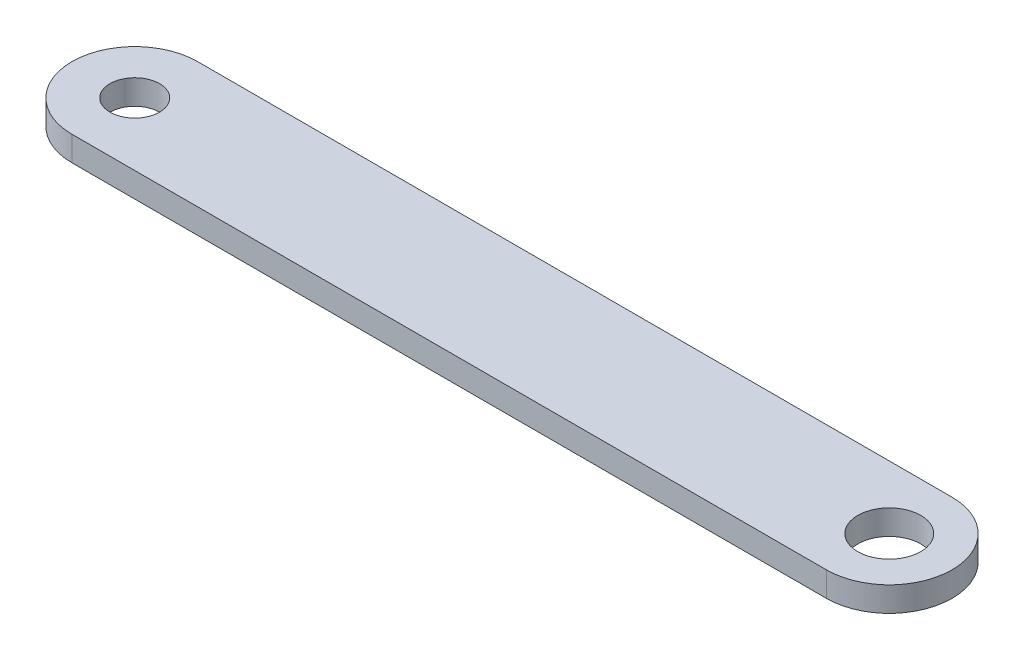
ISO-10303-21;
HEADER;
FILE_DESCRIPTION(('STEP AP214'),'2;1');
FILE_NAME('part.step','',(''),(''),'','','');
FILE_SCHEMA(('AUTOMOTIVE_DESIGN { 1 0 10303 214 1 1 1 1 }'));
ENDSEC;
DATA;
#1=APPLICATION_CONTEXT('core data for automotive mechanical design processes');
#2=APPLICATION_PROTOCOL_DEFINITION('international standard','automotive_design',2000,#1);
#3=PRODUCT_CONTEXT('',#1,'mechanical');
#4=PRODUCT('Part','Part','',(#3));
#5=PRODUCT_RELATED_PRODUCT_CATEGORY('part','',(#4));
#6=PRODUCT_DEFINITION_FORMATION('','',#4);
#7=PRODUCT_DEFINITION_CONTEXT('part definition',#1,'design');
#8=PRODUCT_DEFINITION('design','',#6,#7);
#9=PRODUCT_DEFINITION_SHAPE('','',#8);
#10=(LENGTH_UNIT() NAMED_UNIT(*) SI_UNIT(.MILLI.,.METRE.));
#11=(NAMED_UNIT(*) PLANE_ANGLE_UNIT() SI_UNIT($,.RADIAN.));
#12=(NAMED_UNIT(*) SI_UNIT($,.STERADIAN.) SOLID_ANGLE_UNIT());
#13=UNCERTAINTY_MEASURE_WITH_UNIT(LENGTH_MEASURE(1.E-05),#10,'distance_accuracy_value','');
#14=(GEOMETRIC_REPRESENTATION_CONTEXT(3) GLOBAL_UNCERTAINTY_ASSIGNED_CONTEXT((#13)) GLOBAL_UNIT_ASSIGNED_CONTEXT((#10,
#11,#12)) REPRESENTATION_CONTEXT('',''));
#15=CARTESIAN_POINT('',(0.,0.,0.));
#16=DIRECTION('',(0.,0.,1.));
#17=DIRECTION('',(1.,0.,0.));
#18=AXIS2_PLACEMENT_3D('',#15,#16,#17);
#19=CARTESIAN_POINT('',(-73.5541666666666,5.,1.32291666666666));
#20=DIRECTION('',(0.,-1.,0.));
#21=DIRECTION('',(0.,0.,-1.));
#22=AXIS2_PLACEMENT_3D('',#19,#20,#21);
#23=CYLINDRICAL_SURFACE('',#22,12.7);
#24=CARTESIAN_POINT('',(-73.5541666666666,0.,1.32291666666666));
#25=DIRECTION('',(0.,1.,0.));
#26=DIRECTION('',(0.,0.,-1.));
#27=AXIS2_PLACEMENT_3D('',#24,#25,#26);
#28=CIRCLE('',#27,12.7);
#29=CARTESIAN_POINT('',(-73.5541666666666,0.,-11.3770833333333));
#30=VERTEX_POINT('',#29);
#31=CARTESIAN_POINT('',(-73.5541666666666,0.,14.0229166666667));
#32=VERTEX_POINT('',#31);
#33=EDGE_CURVE('E96',#30,#32,#28,.T.);
#34=ORIENTED_EDGE('',*,*,#33,.T.);
#35=DIRECTION('',(0.,-1.,0.));
#36=VECTOR('',#35,1.);
#37=CARTESIAN_POINT('',(-73.5541666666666,5.,14.0229166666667));
#38=LINE('',#37,#36);
#39=CARTESIAN_POINT('',(-73.5541666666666,5.,14.0229166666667));
#40=VERTEX_POINT('',#39);
#41=EDGE_CURVE('E11',#40,#32,#38,.T.);
#42=ORIENTED_EDGE('',*,*,#41,.F.);
#43=CARTESIAN_POINT('',(-73.5541666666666,5.,1.32291666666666));
#44=DIRECTION('',(0.,1.,0.));
#45=DIRECTION('',(0.,0.,-1.));
#46=AXIS2_PLACEMENT_3D('',#43,#44,#45);
#47=CIRCLE('',#46,12.7);
#48=CARTESIAN_POINT('',(-73.5541666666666,5.,-11.3770833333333));
#49=VERTEX_POINT('',#48);
#50=EDGE_CURVE('E84',#49,#40,#47,.T.);
#51=ORIENTED_EDGE('',*,*,#50,.F.);
#52=DIRECTION('',(0.,-1.,0.));
#53=VECTOR('',#52,1.);
#54=CARTESIAN_POINT('',(-73.5541666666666,5.,-11.3770833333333));
#55=LINE('',#54,#53);
#56=EDGE_CURVE('E92',#49,#30,#55,.T.);
#57=ORIENTED_EDGE('',*,*,#56,.T.);
#58=EDGE_LOOP('',(#34,#42,#51,#57));
#59=FACE_BOUND('',#58,.T.);
#60=ADVANCED_FACE('F33',(#59),#23,.T.);
#61=CARTESIAN_POINT('',(-73.5541666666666,5.,14.0229166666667));
#62=DIRECTION('',(0.,0.,-1.));
#63=DIRECTION('',(-1.,0.,0.));
#64=AXIS2_PLACEMENT_3D('',#61,#62,#63);
#65=PLANE('',#64);
#66=DIRECTION('',(1.,0.,0.));
#67=VECTOR('',#66,1.);
#68=CARTESIAN_POINT('',(-73.5541666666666,0.,14.0229166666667));
#69=LINE('',#68,#67);
#70=CARTESIAN_POINT('',(78.8458333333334,0.,14.0229166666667));
#71=VERTEX_POINT('',#70);
#72=EDGE_CURVE('E88',#32,#71,#69,.T.);
#73=ORIENTED_EDGE('',*,*,#72,.T.);
#74=DIRECTION('',(0.,-1.,0.));
#75=VECTOR('',#74,1.);
#76=CARTESIAN_POINT('',(78.8458333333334,5.,14.0229166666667));
#77=LINE('',#76,#75);
#78=CARTESIAN_POINT('',(78.8458333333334,5.,14.0229166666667));
#79=VERTEX_POINT('',#78);
#80=EDGE_CURVE('E41',#79,#71,#77,.T.);
#81=ORIENTED_EDGE('',*,*,#80,.F.);
#82=DIRECTION('',(1.,0.,0.));
#83=VECTOR('',#82,1.);
#84=CARTESIAN_POINT('',(-73.5541666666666,5.,14.0229166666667));
#85=LINE('',#84,#83);
#86=EDGE_CURVE('E79',#40,#79,#85,.T.);
#87=ORIENTED_EDGE('',*,*,#86,.F.);
#88=ORIENTED_EDGE('',*,*,#41,.T.);
#89=EDGE_LOOP('',(#73,#81,#87,#88));
#90=FACE_BOUND('',#89,.T.);
#91=ADVANCED_FACE('F87',(#90),#65,.F.);
#92=CARTESIAN_POINT('',(78.8458333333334,5.,1.32291666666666));
#93=DIRECTION('',(0.,-1.,0.));
#94=DIRECTION('',(0.,0.,-1.));
#95=AXIS2_PLACEMENT_3D('',#92,#93,#94);
#96=CYLINDRICAL_SURFACE('',#95,12.7);
#97=CARTESIAN_POINT('',(78.8458333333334,0.,1.32291666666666));
#98=DIRECTION('',(0.,1.,0.));
#99=DIRECTION('',(0.,0.,-1.));
#100=AXIS2_PLACEMENT_3D('',#97,#98,#99);
#101=CIRCLE('',#100,12.7);
#102=CARTESIAN_POINT('',(78.8458333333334,0.,-11.3770833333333));
#103=VERTEX_POINT('',#102);
#104=EDGE_CURVE('E66',#71,#103,#101,.T.);
#105=ORIENTED_EDGE('',*,*,#104,.T.);
#106=DIRECTION('',(0.,-1.,0.));
#107=VECTOR('',#106,1.);
#108=CARTESIAN_POINT('',(78.8458333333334,5.,-11.3770833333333));
#109=LINE('',#108,#107);
#110=CARTESIAN_POINT('',(78.8458333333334,5.,-11.3770833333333));
#111=VERTEX_POINT('',#110);
#112=EDGE_CURVE('E89',#111,#103,#109,.T.);
#113=ORIENTED_EDGE('',*,*,#112,.F.);
#114=CARTESIAN_POINT('',(78.8458333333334,5.,1.32291666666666));
#115=DIRECTION('',(0.,1.,0.));
#116=DIRECTION('',(0.,0.,-1.));
#117=AXIS2_PLACEMENT_3D('',#114,#115,#116);
#118=CIRCLE('',#117,12.7);
#119=EDGE_CURVE('E82',#79,#111,#118,.T.);
#120=ORIENTED_EDGE('',*,*,#119,.F.);
#121=ORIENTED_EDGE('',*,*,#80,.T.);
#122=EDGE_LOOP('',(#105,#113,#120,#121));
#123=FACE_BOUND('',#122,.T.);
#124=ADVANCED_FACE('F90',(#123),#96,.T.);
#125=CARTESIAN_POINT('',(-73.5541666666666,5.,-11.3770833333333));
#126=DIRECTION('',(0.,0.,1.));
#127=DIRECTION('',(1.,0.,0.));
#128=AXIS2_PLACEMENT_3D('',#125,#126,#127);
#129=PLANE('',#128);
#130=DIRECTION('',(-1.,0.,0.));
#131=VECTOR('',#130,1.);
#132=CARTESIAN_POINT('',(-73.5541666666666,0.,-11.3770833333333));
#133=LINE('',#132,#131);
#134=EDGE_CURVE('E72',#103,#30,#133,.T.);
#135=ORIENTED_EDGE('',*,*,#134,.T.);
#136=ORIENTED_EDGE('',*,*,#56,.F.);
#137=DIRECTION('',(-1.,0.,0.));
#138=VECTOR('',#137,1.);
#139=CARTESIAN_POINT('',(-73.5541666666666,5.,-11.3770833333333));
#140=LINE('',#139,#138);
#141=EDGE_CURVE('E49',#111,#49,#140,.T.);
#142=ORIENTED_EDGE('',*,*,#141,.F.);
#143=ORIENTED_EDGE('',*,*,#112,.T.);
#144=EDGE_LOOP('',(#135,#136,#142,#143));
#145=FACE_BOUND('',#144,.T.);
#146=ADVANCED_FACE('F104',(#145),#129,.F.);
#147=CARTESIAN_POINT('',(-73.5541666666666,5.,1.32291666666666));
#148=DIRECTION('',(0.,-1.,0.));
#149=DIRECTION('',(0.,0.,-1.));
#150=AXIS2_PLACEMENT_3D('',#147,#148,#149);
#151=PLANE('',#150);
#152=CARTESIAN_POINT('',(78.8458333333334,5.,1.32291666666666));
#153=DIRECTION('',(0.,-1.,0.));
#154=DIRECTION('',(0.,0.,-1.));
#155=AXIS2_PLACEMENT_3D('',#152,#153,#154);
#156=CIRCLE('',#155,6.35);
#157=CARTESIAN_POINT('',(78.8458333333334,5.,-5.02708333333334));
#158=VERTEX_POINT('',#157);
#159=EDGE_CURVE('E113',#158,#158,#156,.T.);
#160=ORIENTED_EDGE('',*,*,#159,.T.);
#161=EDGE_LOOP('',(#160));
#162=FACE_BOUND('',#161,.T.);
#163=CARTESIAN_POINT('',(-73.5541666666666,5.,1.32291666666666));
#164=DIRECTION('',(0.,1.,0.));
#165=DIRECTION('',(0.,0.,1.));
#166=AXIS2_PLACEMENT_3D('',#163,#164,#165);
#167=CIRCLE('',#166,5.);
#168=CARTESIAN_POINT('',(-73.5541666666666,5.,6.32291666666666));
#169=VERTEX_POINT('',#168);
#170=EDGE_CURVE('E99',#169,#169,#167,.T.);
#171=ORIENTED_EDGE('',*,*,#170,.F.);
#172=EDGE_LOOP('',(#171));
#173=FACE_BOUND('',#172,.T.);
#174=ORIENTED_EDGE('',*,*,#50,.T.);
#175=ORIENTED_EDGE('',*,*,#86,.T.);
#176=ORIENTED_EDGE('',*,*,#119,.T.);
#177=ORIENTED_EDGE('',*,*,#141,.T.);
#178=EDGE_LOOP('',(#174,#175,#176,#177));
#179=FACE_BOUND('',#178,.T.);
#180=ADVANCED_FACE('F80',(#162,#173,#179),#151,.F.);
#181=CARTESIAN_POINT('',(-73.5541666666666,0.,1.32291666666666));
#182=DIRECTION('',(0.,-1.,0.));
#183=DIRECTION('',(0.,0.,-1.));
#184=AXIS2_PLACEMENT_3D('',#181,#182,#183);
#185=PLANE('',#184);
#186=CARTESIAN_POINT('',(78.8458333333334,0.,1.32291666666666));
#187=DIRECTION('',(0.,-1.,0.));
#188=DIRECTION('',(0.,0.,-1.));
#189=AXIS2_PLACEMENT_3D('',#186,#187,#188);
#190=CIRCLE('',#189,6.35);
#191=CARTESIAN_POINT('',(78.8458333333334,0.,-5.02708333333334));
#192=VERTEX_POINT('',#191);
#193=EDGE_CURVE('E116',#192,#192,#190,.T.);
#194=ORIENTED_EDGE('',*,*,#193,.F.);
#195=EDGE_LOOP('',(#194));
#196=FACE_BOUND('',#195,.T.);
#197=CARTESIAN_POINT('',(-73.5541666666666,0.,1.32291666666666));
#198=DIRECTION('',(0.,1.,0.));
#199=DIRECTION('',(0.,0.,1.));
#200=AXIS2_PLACEMENT_3D('',#197,#198,#199);
#201=CIRCLE('',#200,5.);
#202=CARTESIAN_POINT('',(-73.5541666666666,0.,6.32291666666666));
#203=VERTEX_POINT('',#202);
#204=EDGE_CURVE('E110',#203,#203,#201,.T.);
#205=ORIENTED_EDGE('',*,*,#204,.T.);
#206=EDGE_LOOP('',(#205));
#207=FACE_BOUND('',#206,.T.);
#208=ORIENTED_EDGE('',*,*,#33,.F.);
#209=ORIENTED_EDGE('',*,*,#134,.F.);
#210=ORIENTED_EDGE('',*,*,#104,.F.);
#211=ORIENTED_EDGE('',*,*,#72,.F.);
#212=EDGE_LOOP('',(#208,#209,#210,#211));
#213=FACE_BOUND('',#212,.T.);
#214=ADVANCED_FACE('F107',(#196,#207,#213),#185,.T.);
#215=CARTESIAN_POINT('',(-73.5541666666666,5.,1.32291666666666));
#216=DIRECTION('',(0.,-1.,0.));
#217=DIRECTION('',(0.,0.,-1.));
#218=AXIS2_PLACEMENT_3D('',#215,#216,#217);
#219=CYLINDRICAL_SURFACE('',#218,5.);
#220=ORIENTED_EDGE('',*,*,#170,.T.);
#221=EDGE_LOOP('',(#220));
#222=FACE_BOUND('',#221,.T.);
#223=ORIENTED_EDGE('',*,*,#204,.F.);
#224=EDGE_LOOP('',(#223));
#225=FACE_BOUND('',#224,.T.);
#226=ADVANCED_FACE('F127',(#222,#225),#219,.F.);
#227=CARTESIAN_POINT('',(78.8458333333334,5.,1.32291666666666));
#228=DIRECTION('',(0.,-1.,0.));
#229=DIRECTION('',(0.,0.,-1.));
#230=AXIS2_PLACEMENT_3D('',#227,#228,#229);
#231=CYLINDRICAL_SURFACE('',#230,6.35);
#232=ORIENTED_EDGE('',*,*,#159,.F.);
#233=EDGE_LOOP('',(#232));
#234=FACE_BOUND('',#233,.T.);
#235=ORIENTED_EDGE('',*,*,#193,.T.);
#236=EDGE_LOOP('',(#235));
#237=FACE_BOUND('',#236,.T.);
#238=ADVANCED_FACE('F124',(#234,#237),#231,.F.);
#239=CLOSED_SHELL('',(#60,#91,#124,#146,#180,#214,#226,#238));
#240=MANIFOLD_SOLID_BREP('B2',#239);
#241=ADVANCED_BREP_SHAPE_REPRESENTATION('',(#18,#240),#14);
#242=SHAPE_DEFINITION_REPRESENTATION(#9,#241);
ENDSEC;
END-ISO-10303-21;
